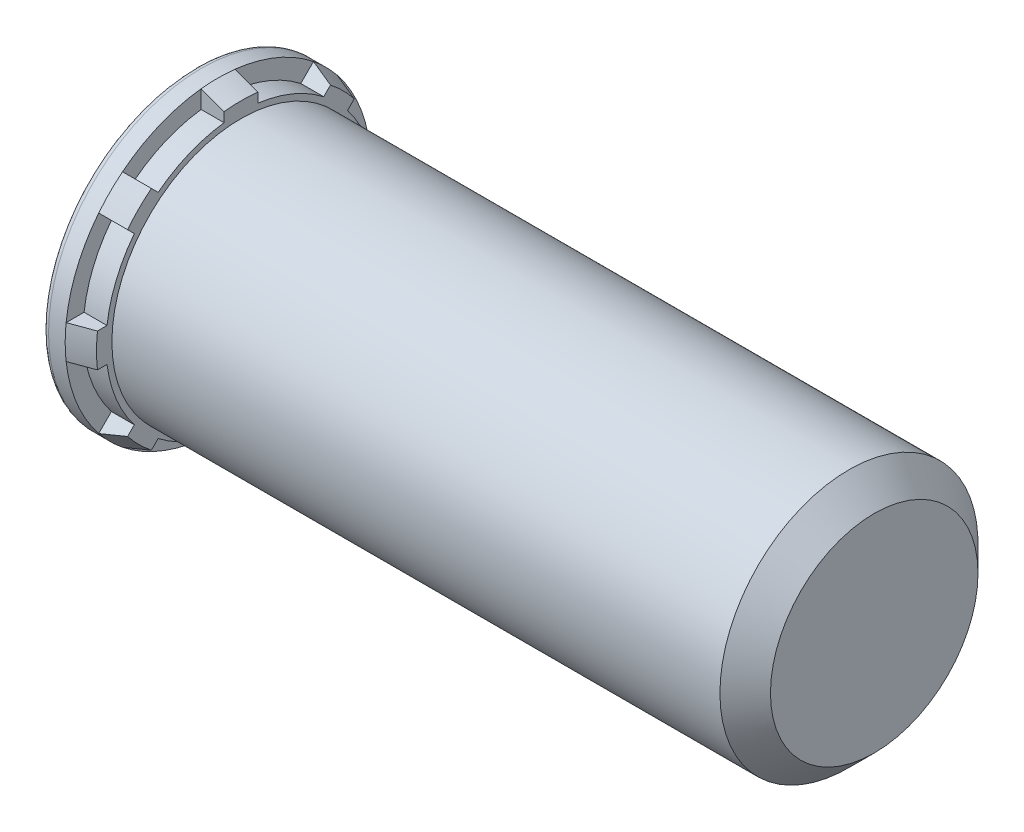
from build123d import *

# Parameters (mm, degrees)
RIBCUT_START     = -0.428625
RIBCUT_DEPTH     = 0.428625
RIBCUTSPAT_COUNT = 8
RIBCUTSPAT_ANGLE = 315


with BuildPart() as part:
    # BodySke → BaseBody (revolve)
    with BuildSketch(Plane.XY, mode=Mode.PRIVATE) as basebody_sk:
        with BuildLine():
            Line((-0.428625, 2.74066), (-0.428625, 0))
            Line((-0.428625, 0), (12.271375, 0))
            Line((12.271375, 0), (12.271375, 1.94056))
            Line((12.271375, 1.94056), (11.798935, 2.413))
            Line((11.798935, 2.413), (0.428625, 2.413))
            Line((0.428625, 2.413), (0.428625, 2.701493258))
            Line((0.428625, 2.701493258), (0, 2.8575))
            Line((0, 2.8575), (-0.311785, 2.8575))
            ThreePointArc((-0.311785, 2.8575), (-0.392607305, 2.824022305), (-0.426085, 2.7432))
            Line((-0.426085, 2.7432), (-0.426085, 2.74066))
            Line((-0.426085, 2.74066), (-0.428625, 2.74066))
        make_face()
    revolve(basebody_sk.sketch.rotate(Axis((0, 0, 0), (1, 0, 0)), 90), axis=Axis((0, 0, 0), (1, 0, 0)))

    # RibCutSke → RibCut (cut)
    with BuildSketch(Plane(origin=(0.428625, 1.794401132, -0.090952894), x_dir=(0, 0, -1), z_dir=(1, 0, 0)).offset(RIBCUT_START)):
        with BuildLine():
            Line((0.224006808, 0.70999648), (0.224006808, 1.045688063))
            ThreePointArc((0.224006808, 1.045688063), (1.002565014, 0.845584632), (1.694583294, 0.436555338))
            Line((1.694583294, 0.436555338), (1.4572135, 0.199185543))
            ThreePointArc((1.4572135, 0.199185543), (0.874987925, 0.537586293), (0.224006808, 0.70999648))
        make_face()
    ribcut = extrude(amount=RIBCUT_DEPTH, mode=Mode.SUBTRACT)

    # RibCutsPat: RibCut ×8 about axis
    ribcutspat_axis = Axis((0, 0, 0), (1, 0, 0))
    for i in range(1, RIBCUTSPAT_COUNT):
        add(ribcut.rotate(ribcutspat_axis, i * RIBCUTSPAT_ANGLE / (RIBCUTSPAT_COUNT - 1)), mode=Mode.SUBTRACT)


solid = part.part
